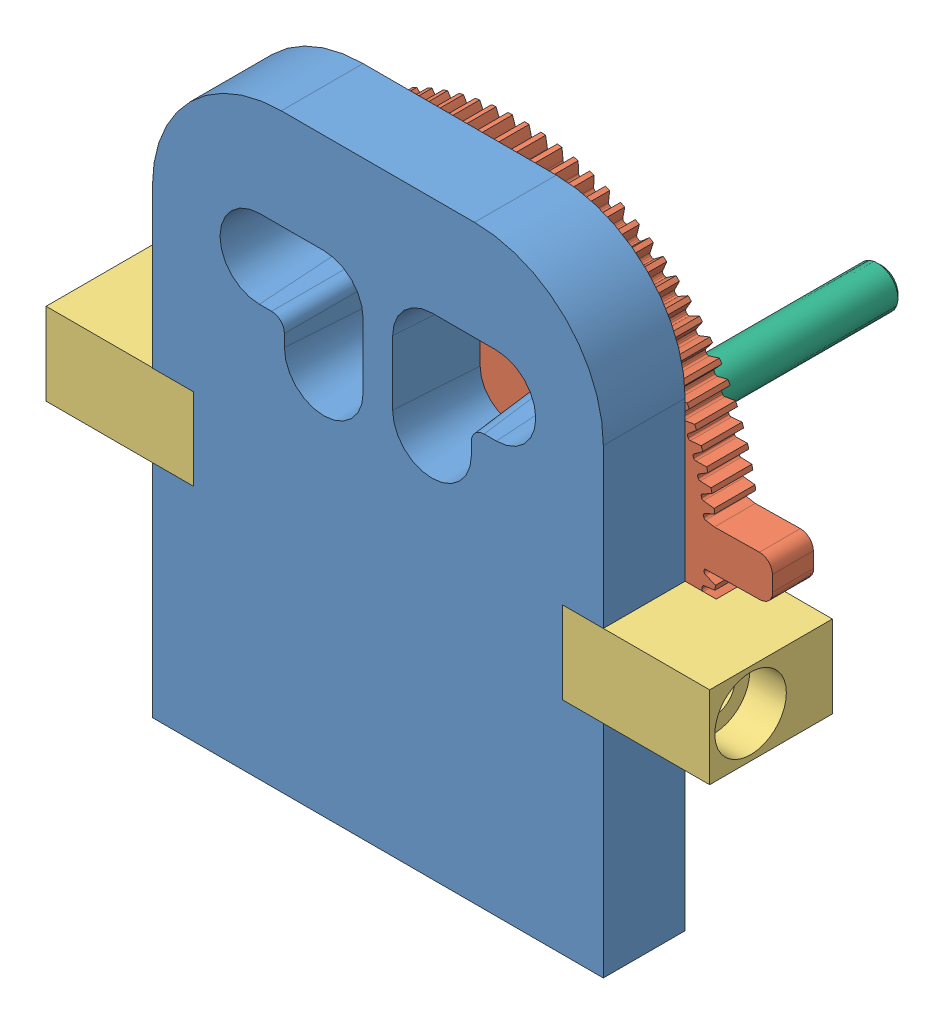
SolidWorks assembly MASK_MECH.SLDASM, configuration Default (file format 7000). Lengths in mm.
Overall size (51.51 45.8 50.8).
7 component instances, 6 part files, 15 mates.
Components (placement in the parent):
- MASK_BASE-1: MASK_BASE.SLDPRT [Default] at origin size (35 45.8 6.35)
- MASK_WHEEL_36-2: MASK_WHEEL_36.sldprt [Default] at (0 2.1 -1.5875) x (0.999881 0.015428 0) z (0 0 -1) size (41.1 36.79 3.17)
- MASK_Hard_Stop-1: MASK_Hard_Stop.SLDPRT [Default] at (-14.325 0.6311 6.35) x (0 0 -1) z (-1 0 0) size (9.53 6.38 11.43)
- MASK_Hard_Stop-2: MASK_Hard_Stop.SLDPRT [Default] at (14.325 -5.7811 6.35) x (0 0 -1) z (1 0 0) size (9.53 6.38 11.43)
- SPUR_GEAR-1: SPUR_GEAR.sldprt [Default] at (-11.6976 -16.2599 -4.7625) x (0.915556 -0.40219 0) z (0 0 1) size (8.8 8.8 6.35)
- 96126A123-1: 96126A123.SLDPRT [96126A123] at (0 2.1 -7.9375) x (-0.112322 0.993672 0) z (0 0 -1) size (6.35 6.35 12.28)
- 1162K107-1: 1162K107.SLDPRT [1162K107] at (-11.6976 -16.2599 -19.05) x (0.986327 0.164802 0) z (0 0 1) size (3.17 3.17 50.8)
Mates (geometry in assembly coordinates):
- Coincident5: coincident aligned: plane of MASK_BASE-1 through (0 0 0) normal (0 0 -1); plane of MASK_Hard_Stop-1 through (-25.755 0.6311 0) normal (0 0 -1)
- Concentric3: concentric aligned: circle of MASK_BASE-1; cylinder of MASK_Hard_Stop-1 through (-25.755 -2.575 3.175) axis (-1 0 0) radius 1.632
- Coincident6: coincident anti-aligned: plane of MASK_BASE-1 through (-14.325 0 0) normal (-1 0 0); plane of MASK_Hard_Stop-1 through (-14.325 0.6311 6.35) normal (1 0 0)
- Coincident7: coincident anti-aligned: plane of MASK_BASE-1 through (14.325 0 0) normal (1 0 0); plane of MASK_Hard_Stop-2 through (14.325 -5.7811 6.35) normal (-1 0 0)
- Coincident8: coincident aligned: plane of MASK_BASE-1 through (0 0 0) normal (0 0 -1); plane of MASK_Hard_Stop-2 through (25.755 -5.7811 0) normal (0 0 -1)
- Concentric4: concentric anti-aligned: circle of MASK_BASE-1; circle of MASK_Hard_Stop-2
- Distance1: distance = 22 mm: point of SPUR_GEAR-1; point of MASK_WHEEL_36-2
- GearMate1: gear = 25.4 mm: line of MASK_WHEEL_36-2 through (0 2.1 34.8932) axis (0 0 -1); line of SPUR_GEAR-1 through (-11.6976 -16.2599 -41.2432) axis (0 0 1)
- Distance3: distance = 1.5875 mm anti-aligned: plane of MASK_BASE-1 through (0 0 0) normal (0 0 -1); plane of MASK_WHEEL_36-2 through (0 2.1 -1.5875) normal (0 0 1)
- Distance4: distance = 1.5875 mm anti-aligned: plane of SPUR_GEAR-1 through (-11.6976 -16.2599 -1.5875) normal (0 0 1); plane of MASK_BASE-1 through (0 0 0) normal (0 0 -1)
- Coincident9: coincident anti-aligned: plane of MASK_WHEEL_36-2 through (0 2.1 -4.7625) normal (0 0 -1); circle of 96126A123-1
- Concentric8: concentric anti-aligned: cylinder of SPUR_GEAR-1 through (-11.6976 -16.2599 -12704.7625) axis (0 0 1) radius 1.5875; cylinder of 1162K107-1 through (-11.6976 -16.2599 6.35) axis (0 0 -1) radius 1.5875
- Coincident11: coincident aligned: plane of MASK_BASE-1 through (0 0 6.35) normal (0 0 1); plane of 1162K107-1 through (-11.6976 -16.2599 6.35) normal (0 0 1)
- Concentric9: concentric aligned: line of MASK_WHEEL_36-2 through (0 2.1 34.8932) axis (0 0 -1); circle of MASK_BASE-1
- Concentric10: concentric anti-aligned: line of MASK_WHEEL_36-2 through (0 2.1 34.8932) axis (0 0 -1); circle of 96126A123-1
